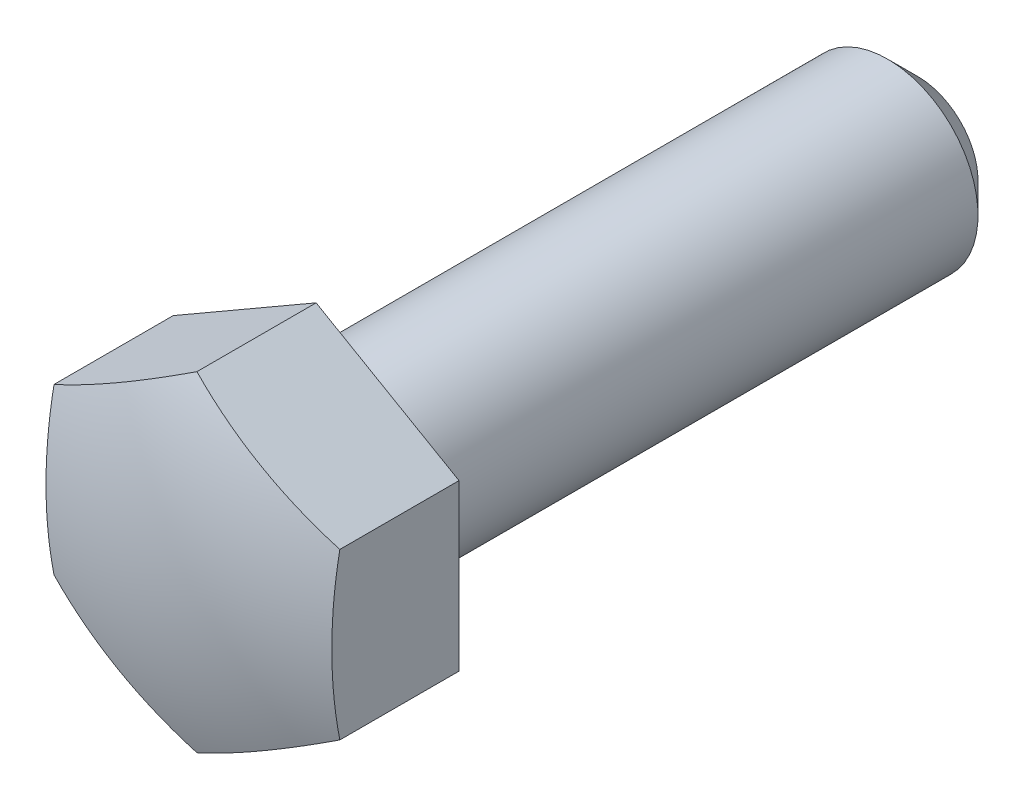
ISO-10303-21;
HEADER;
FILE_DESCRIPTION(('STEP AP214'),'2;1');
FILE_NAME('part.step','',(''),(''),'','','');
FILE_SCHEMA(('AUTOMOTIVE_DESIGN { 1 0 10303 214 1 1 1 1 }'));
ENDSEC;
DATA;
#1=APPLICATION_CONTEXT('core data for automotive mechanical design processes');
#2=APPLICATION_PROTOCOL_DEFINITION('international standard','automotive_design',2000,#1);
#3=PRODUCT_CONTEXT('',#1,'mechanical');
#4=PRODUCT('Part','Part','',(#3));
#5=PRODUCT_RELATED_PRODUCT_CATEGORY('part','',(#4));
#6=PRODUCT_DEFINITION_FORMATION('','',#4);
#7=PRODUCT_DEFINITION_CONTEXT('part definition',#1,'design');
#8=PRODUCT_DEFINITION('design','',#6,#7);
#9=PRODUCT_DEFINITION_SHAPE('','',#8);
#10=(LENGTH_UNIT() NAMED_UNIT(*) SI_UNIT(.MILLI.,.METRE.));
#11=(NAMED_UNIT(*) PLANE_ANGLE_UNIT() SI_UNIT($,.RADIAN.));
#12=(NAMED_UNIT(*) SI_UNIT($,.STERADIAN.) SOLID_ANGLE_UNIT());
#13=UNCERTAINTY_MEASURE_WITH_UNIT(LENGTH_MEASURE(1.E-05),#10,'distance_accuracy_value','');
#14=(GEOMETRIC_REPRESENTATION_CONTEXT(3) GLOBAL_UNCERTAINTY_ASSIGNED_CONTEXT((#13)) GLOBAL_UNIT_ASSIGNED_CONTEXT((#10,
#11,#12)) REPRESENTATION_CONTEXT('',''));
#15=CARTESIAN_POINT('',(0.,0.,0.));
#16=DIRECTION('',(0.,0.,1.));
#17=DIRECTION('',(1.,0.,0.));
#18=AXIS2_PLACEMENT_3D('',#15,#16,#17);
#19=CARTESIAN_POINT('',(9.5,-5.48482755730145,12.));
#20=DIRECTION('',(-1.,0.,0.));
#21=DIRECTION('',(0.,0.,1.));
#22=AXIS2_PLACEMENT_3D('',#19,#20,#21);
#23=PLANE('',#22);
#24=CARTESIAN_POINT('',(9.5,0.,-20.));
#25=DIRECTION('',(-1.,0.,0.));
#26=DIRECTION('',(0.,0.,1.));
#27=AXIS2_PLACEMENT_3D('',#24,#25,#26);
#28=CIRCLE('',#27,28.4561065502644);
#29=CARTESIAN_POINT('',(9.5,-5.48482755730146,7.92251182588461));
#30=VERTEX_POINT('',#29);
#31=CARTESIAN_POINT('',(9.5,5.48482755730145,7.92251182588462));
#32=VERTEX_POINT('',#31);
#33=EDGE_CURVE('E28',#30,#32,#28,.T.);
#34=ORIENTED_EDGE('',*,*,#33,.F.);
#35=DIRECTION('',(0.,0.,-1.));
#36=VECTOR('',#35,1.);
#37=CARTESIAN_POINT('',(9.5,-5.48482755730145,12.));
#38=LINE('',#37,#36);
#39=CARTESIAN_POINT('',(9.5,-5.48482755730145,0.));
#40=VERTEX_POINT('',#39);
#41=EDGE_CURVE('E229',#30,#40,#38,.T.);
#42=ORIENTED_EDGE('',*,*,#41,.T.);
#43=DIRECTION('',(0.,-1.,0.));
#44=VECTOR('',#43,1.);
#45=CARTESIAN_POINT('',(9.5,5.48482755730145,0.));
#46=LINE('',#45,#44);
#47=CARTESIAN_POINT('',(9.5,5.48482755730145,0.));
#48=VERTEX_POINT('',#47);
#49=EDGE_CURVE('E216',#48,#40,#46,.T.);
#50=ORIENTED_EDGE('',*,*,#49,.F.);
#51=DIRECTION('',(0.,0.,-1.));
#52=VECTOR('',#51,1.);
#53=CARTESIAN_POINT('',(9.5,5.48482755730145,12.));
#54=LINE('',#53,#52);
#55=EDGE_CURVE('E227',#32,#48,#54,.T.);
#56=ORIENTED_EDGE('',*,*,#55,.F.);
#57=EDGE_LOOP('',(#34,#42,#50,#56));
#58=FACE_BOUND('',#57,.T.);
#59=ADVANCED_FACE('F14',(#58),#23,.F.);
#60=CARTESIAN_POINT('',(0.,-10.9696551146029,12.));
#61=DIRECTION('',(-0.5,0.866025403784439,0.));
#62=DIRECTION('',(-0.866025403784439,-0.5,0.));
#63=AXIS2_PLACEMENT_3D('',#60,#61,#62);
#64=PLANE('',#63);
#65=CARTESIAN_POINT('',(4.75,-8.22724133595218,-20.));
#66=DIRECTION('',(-0.5,0.866025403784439,0.));
#67=DIRECTION('',(-0.866025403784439,-0.5,0.));
#68=AXIS2_PLACEMENT_3D('',#65,#66,#67);
#69=CIRCLE('',#68,28.4561065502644);
#70=CARTESIAN_POINT('',(0.,-10.9696551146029,7.92251182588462));
#71=VERTEX_POINT('',#70);
#72=EDGE_CURVE('E208',#71,#30,#69,.T.);
#73=ORIENTED_EDGE('',*,*,#72,.F.);
#74=DIRECTION('',(0.,0.,-1.));
#75=VECTOR('',#74,1.);
#76=CARTESIAN_POINT('',(0.,-10.9696551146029,12.));
#77=LINE('',#76,#75);
#78=CARTESIAN_POINT('',(0.,-10.9696551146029,0.));
#79=VERTEX_POINT('',#78);
#80=EDGE_CURVE('E231',#71,#79,#77,.T.);
#81=ORIENTED_EDGE('',*,*,#80,.T.);
#82=DIRECTION('',(-0.866025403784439,-0.5,0.));
#83=VECTOR('',#82,1.);
#84=CARTESIAN_POINT('',(9.5,-5.48482755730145,0.));
#85=LINE('',#84,#83);
#86=EDGE_CURVE('E219',#40,#79,#85,.T.);
#87=ORIENTED_EDGE('',*,*,#86,.F.);
#88=ORIENTED_EDGE('',*,*,#41,.F.);
#89=EDGE_LOOP('',(#73,#81,#87,#88));
#90=FACE_BOUND('',#89,.T.);
#91=ADVANCED_FACE('F115',(#90),#64,.F.);
#92=CARTESIAN_POINT('',(-9.5,-5.48482755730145,12.));
#93=DIRECTION('',(0.5,0.866025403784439,0.));
#94=DIRECTION('',(-0.866025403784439,0.5,0.));
#95=AXIS2_PLACEMENT_3D('',#92,#93,#94);
#96=PLANE('',#95);
#97=CARTESIAN_POINT('',(-4.75,-8.22724133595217,-20.));
#98=DIRECTION('',(0.5,0.866025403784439,0.));
#99=DIRECTION('',(-0.866025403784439,0.5,0.));
#100=AXIS2_PLACEMENT_3D('',#97,#98,#99);
#101=CIRCLE('',#100,28.4561065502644);
#102=CARTESIAN_POINT('',(-9.5,-5.48482755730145,7.92251182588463));
#103=VERTEX_POINT('',#102);
#104=EDGE_CURVE('E206',#103,#71,#101,.T.);
#105=ORIENTED_EDGE('',*,*,#104,.F.);
#106=DIRECTION('',(0.,0.,-1.));
#107=VECTOR('',#106,1.);
#108=CARTESIAN_POINT('',(-9.5,-5.48482755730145,12.));
#109=LINE('',#108,#107);
#110=CARTESIAN_POINT('',(-9.5,-5.48482755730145,0.));
#111=VERTEX_POINT('',#110);
#112=EDGE_CURVE('E87',#103,#111,#109,.T.);
#113=ORIENTED_EDGE('',*,*,#112,.T.);
#114=DIRECTION('',(-0.866025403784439,0.5,0.));
#115=VECTOR('',#114,1.);
#116=CARTESIAN_POINT('',(0.,-10.9696551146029,0.));
#117=LINE('',#116,#115);
#118=EDGE_CURVE('E222',#79,#111,#117,.T.);
#119=ORIENTED_EDGE('',*,*,#118,.F.);
#120=ORIENTED_EDGE('',*,*,#80,.F.);
#121=EDGE_LOOP('',(#105,#113,#119,#120));
#122=FACE_BOUND('',#121,.T.);
#123=ADVANCED_FACE('F120',(#122),#96,.F.);
#124=CARTESIAN_POINT('',(-9.5,5.48482755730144,12.));
#125=DIRECTION('',(1.,0.,0.));
#126=DIRECTION('',(0.,1.,0.));
#127=AXIS2_PLACEMENT_3D('',#124,#125,#126);
#128=PLANE('',#127);
#129=CARTESIAN_POINT('',(-9.5,0.,-20.));
#130=DIRECTION('',(1.,0.,0.));
#131=DIRECTION('',(0.,1.,0.));
#132=AXIS2_PLACEMENT_3D('',#129,#130,#131);
#133=CIRCLE('',#132,28.4561065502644);
#134=CARTESIAN_POINT('',(-9.5,5.48482755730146,7.92251182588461));
#135=VERTEX_POINT('',#134);
#136=EDGE_CURVE('E76',#135,#103,#133,.T.);
#137=ORIENTED_EDGE('',*,*,#136,.F.);
#138=DIRECTION('',(0.,0.,-1.));
#139=VECTOR('',#138,1.);
#140=CARTESIAN_POINT('',(-9.5,5.48482755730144,12.));
#141=LINE('',#140,#139);
#142=CARTESIAN_POINT('',(-9.5,5.48482755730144,0.));
#143=VERTEX_POINT('',#142);
#144=EDGE_CURVE('E36',#135,#143,#141,.T.);
#145=ORIENTED_EDGE('',*,*,#144,.T.);
#146=DIRECTION('',(0.,1.,0.));
#147=VECTOR('',#146,1.);
#148=CARTESIAN_POINT('',(-9.5,-5.48482755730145,0.));
#149=LINE('',#148,#147);
#150=EDGE_CURVE('E225',#111,#143,#149,.T.);
#151=ORIENTED_EDGE('',*,*,#150,.F.);
#152=ORIENTED_EDGE('',*,*,#112,.F.);
#153=EDGE_LOOP('',(#137,#145,#151,#152));
#154=FACE_BOUND('',#153,.T.);
#155=ADVANCED_FACE('F126',(#154),#128,.F.);
#156=CARTESIAN_POINT('',(0.,10.9696551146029,12.));
#157=DIRECTION('',(0.5,-0.866025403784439,0.));
#158=DIRECTION('',(0.866025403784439,0.5,0.));
#159=AXIS2_PLACEMENT_3D('',#156,#157,#158);
#160=PLANE('',#159);
#161=CARTESIAN_POINT('',(-4.75,8.22724133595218,-20.));
#162=DIRECTION('',(0.5,-0.866025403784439,0.));
#163=DIRECTION('',(0.866025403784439,0.5,0.));
#164=AXIS2_PLACEMENT_3D('',#161,#162,#163);
#165=CIRCLE('',#164,28.4561065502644);
#166=CARTESIAN_POINT('',(0.,10.9696551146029,7.92251182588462));
#167=VERTEX_POINT('',#166);
#168=EDGE_CURVE('E67',#167,#135,#165,.T.);
#169=ORIENTED_EDGE('',*,*,#168,.F.);
#170=DIRECTION('',(0.,0.,-1.));
#171=VECTOR('',#170,1.);
#172=CARTESIAN_POINT('',(0.,10.9696551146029,12.));
#173=LINE('',#172,#171);
#174=CARTESIAN_POINT('',(0.,10.9696551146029,0.));
#175=VERTEX_POINT('',#174);
#176=EDGE_CURVE('E74',#167,#175,#173,.T.);
#177=ORIENTED_EDGE('',*,*,#176,.T.);
#178=DIRECTION('',(0.866025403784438,0.5,0.));
#179=VECTOR('',#178,1.);
#180=CARTESIAN_POINT('',(-9.5,5.48482755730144,0.));
#181=LINE('',#180,#179);
#182=EDGE_CURVE('E213',#143,#175,#181,.T.);
#183=ORIENTED_EDGE('',*,*,#182,.F.);
#184=ORIENTED_EDGE('',*,*,#144,.F.);
#185=EDGE_LOOP('',(#169,#177,#183,#184));
#186=FACE_BOUND('',#185,.T.);
#187=ADVANCED_FACE('F72',(#186),#160,.F.);
#188=CARTESIAN_POINT('',(9.5,5.48482755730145,12.));
#189=DIRECTION('',(-0.5,-0.866025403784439,0.));
#190=DIRECTION('',(0.866025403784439,-0.5,0.));
#191=AXIS2_PLACEMENT_3D('',#188,#189,#190);
#192=PLANE('',#191);
#193=CARTESIAN_POINT('',(4.75,8.22724133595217,-20.));
#194=DIRECTION('',(-0.5,-0.866025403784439,0.));
#195=DIRECTION('',(0.866025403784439,-0.5,0.));
#196=AXIS2_PLACEMENT_3D('',#193,#194,#195);
#197=CIRCLE('',#196,28.4561065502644);
#198=EDGE_CURVE('E9',#32,#167,#197,.T.);
#199=ORIENTED_EDGE('',*,*,#198,.F.);
#200=ORIENTED_EDGE('',*,*,#55,.T.);
#201=DIRECTION('',(0.866025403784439,-0.5,0.));
#202=VECTOR('',#201,1.);
#203=CARTESIAN_POINT('',(0.,10.9696551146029,0.));
#204=LINE('',#203,#202);
#205=EDGE_CURVE('E80',#175,#48,#204,.T.);
#206=ORIENTED_EDGE('',*,*,#205,.F.);
#207=ORIENTED_EDGE('',*,*,#176,.F.);
#208=EDGE_LOOP('',(#199,#200,#206,#207));
#209=FACE_BOUND('',#208,.T.);
#210=ADVANCED_FACE('F78',(#209),#192,.F.);
#211=CARTESIAN_POINT('',(0.,0.,2.));
#212=DIRECTION('',(0.,0.,-1.));
#213=DIRECTION('',(-1.,0.,0.));
#214=AXIS2_PLACEMENT_3D('',#211,#212,#213);
#215=CYLINDRICAL_SURFACE('',#214,6.);
#216=CARTESIAN_POINT('',(0.,0.,-38.));
#217=DIRECTION('',(0.,0.,-1.));
#218=DIRECTION('',(-1.,0.,0.));
#219=AXIS2_PLACEMENT_3D('',#216,#217,#218);
#220=CIRCLE('',#219,6.);
#221=CARTESIAN_POINT('',(-6.,0.,-38.));
#222=VERTEX_POINT('',#221);
#223=EDGE_CURVE('E22',#222,#222,#220,.F.);
#224=ORIENTED_EDGE('',*,*,#223,.T.);
#225=EDGE_LOOP('',(#224));
#226=FACE_BOUND('',#225,.T.);
#227=CARTESIAN_POINT('',(0.,0.,0.));
#228=DIRECTION('',(0.,0.,1.));
#229=DIRECTION('',(1.,0.,0.));
#230=AXIS2_PLACEMENT_3D('',#227,#228,#229);
#231=CIRCLE('',#230,6.);
#232=CARTESIAN_POINT('',(6.,0.,0.));
#233=VERTEX_POINT('',#232);
#234=EDGE_CURVE('E82',#233,#233,#231,.T.);
#235=ORIENTED_EDGE('',*,*,#234,.F.);
#236=EDGE_LOOP('',(#235));
#237=FACE_BOUND('',#236,.T.);
#238=ADVANCED_FACE('F95',(#226,#237),#215,.T.);
#239=CARTESIAN_POINT('',(0.,0.,-40.));
#240=DIRECTION('',(0.,0.,-1.));
#241=DIRECTION('',(-1.,0.,0.));
#242=AXIS2_PLACEMENT_3D('',#239,#240,#241);
#243=PLANE('',#242);
#244=CARTESIAN_POINT('',(0.,0.,-40.));
#245=DIRECTION('',(0.,0.,-1.));
#246=DIRECTION('',(-1.,0.,0.));
#247=AXIS2_PLACEMENT_3D('',#244,#245,#246);
#248=CIRCLE('',#247,4.);
#249=CARTESIAN_POINT('',(-4.,0.,-40.));
#250=VERTEX_POINT('',#249);
#251=EDGE_CURVE('E85',#250,#250,#248,.T.);
#252=ORIENTED_EDGE('',*,*,#251,.T.);
#253=EDGE_LOOP('',(#252));
#254=FACE_BOUND('',#253,.T.);
#255=ADVANCED_FACE('F103',(#254),#243,.T.);
#256=CARTESIAN_POINT('',(-19.,0.,0.));
#257=DIRECTION('',(0.,0.,1.));
#258=DIRECTION('',(1.,0.,0.));
#259=AXIS2_PLACEMENT_3D('',#256,#257,#258);
#260=PLANE('',#259);
#261=ORIENTED_EDGE('',*,*,#182,.T.);
#262=ORIENTED_EDGE('',*,*,#205,.T.);
#263=ORIENTED_EDGE('',*,*,#49,.T.);
#264=ORIENTED_EDGE('',*,*,#86,.T.);
#265=ORIENTED_EDGE('',*,*,#118,.T.);
#266=ORIENTED_EDGE('',*,*,#150,.T.);
#267=EDGE_LOOP('',(#261,#262,#263,#264,#265,#266));
#268=FACE_BOUND('',#267,.T.);
#269=ORIENTED_EDGE('',*,*,#234,.T.);
#270=EDGE_LOOP('',(#269));
#271=FACE_BOUND('',#270,.T.);
#272=ADVANCED_FACE('F100',(#268,#271),#260,.F.);
#273=CARTESIAN_POINT('',(0.,0.,-40.));
#274=DIRECTION('',(0.,0.,1.));
#275=DIRECTION('',(1.,0.,0.));
#276=AXIS2_PLACEMENT_3D('',#273,#274,#275);
#277=CONICAL_SURFACE('',#276,4.,0.785398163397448);
#278=ORIENTED_EDGE('',*,*,#223,.F.);
#279=EDGE_LOOP('',(#278));
#280=FACE_BOUND('',#279,.T.);
#281=ORIENTED_EDGE('',*,*,#251,.F.);
#282=EDGE_LOOP('',(#281));
#283=FACE_BOUND('',#282,.T.);
#284=ADVANCED_FACE('F16',(#280,#283),#277,.T.);
#285=CARTESIAN_POINT('',(0.,0.,-20.));
#286=DIRECTION('',(0.,0.,1.));
#287=DIRECTION('',(0.,-1.,0.));
#288=AXIS2_PLACEMENT_3D('',#285,#286,#287);
#289=SPHERICAL_SURFACE('',#288,30.);
#290=ORIENTED_EDGE('',*,*,#33,.T.);
#291=ORIENTED_EDGE('',*,*,#198,.T.);
#292=ORIENTED_EDGE('',*,*,#168,.T.);
#293=ORIENTED_EDGE('',*,*,#136,.T.);
#294=ORIENTED_EDGE('',*,*,#104,.T.);
#295=ORIENTED_EDGE('',*,*,#72,.T.);
#296=EDGE_LOOP('',(#290,#291,#292,#293,#294,#295));
#297=FACE_BOUND('',#296,.T.);
#298=ADVANCED_FACE('F66',(#297),#289,.T.);
#299=CLOSED_SHELL('',(#59,#91,#123,#155,#187,#210,#238,#255,#272,#284,#298));
#300=MANIFOLD_SOLID_BREP('B1',#299);
#301=ADVANCED_BREP_SHAPE_REPRESENTATION('',(#18,#300),#14);
#302=SHAPE_DEFINITION_REPRESENTATION(#9,#301);
ENDSEC;
END-ISO-10303-21;
